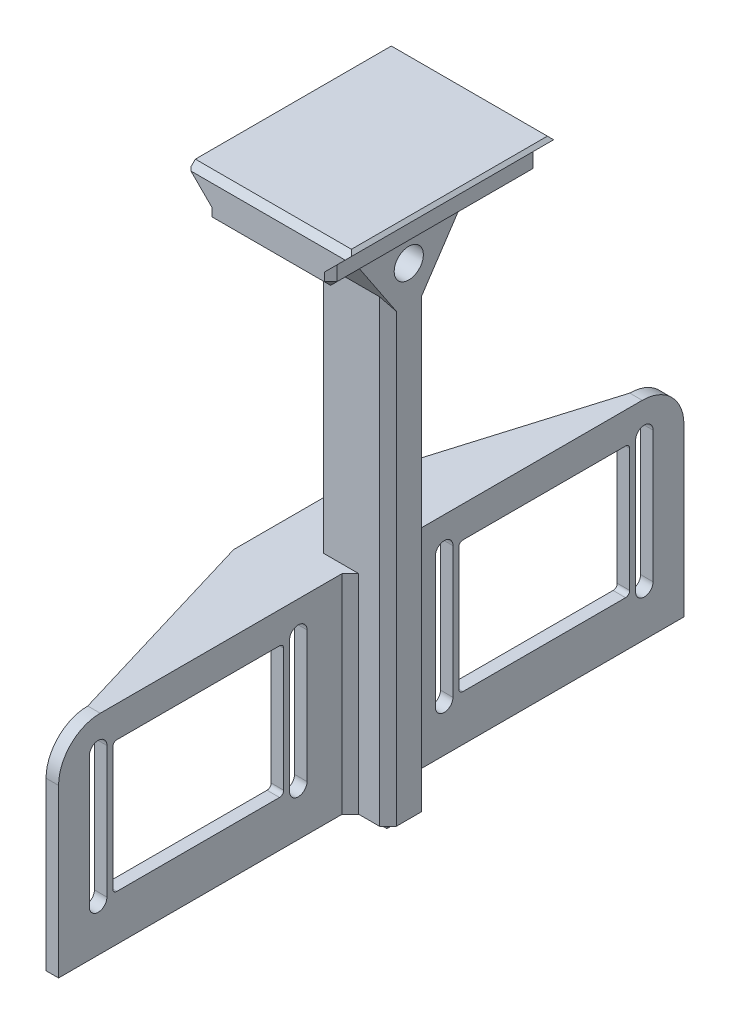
from build123d import *
from OCP.BRepFilletAPI import BRepFilletAPI_MakeChamfer

# Parameters (mm, degrees)
SKETCH_2_W           = 17.5
SKETCH_2_H           = 10
EXTRUDE_1_DEPTH      = 125
SKETCH_3_W           = 50
SKETCH_3_H           = 30
EXTRUDE_2_DEPTH      = 7.5
CHAMFER_1_SIZE       = 1
EXTRUDE_3_DEPTH      = 17.5
CHAMFER_2_SIZE       = 2
CHAMFER_3_SIZE       = 2
SKETCH_6_W           = 10
SKETCH_6_H           = 3
EXTRUDE_4_DEPTH      = 3.1
SKETCH_7_W           = 70
SKETCH_7_H           = 50
EXTRUDE_5_DEPTH      = 3.25
SKETCH_15_W          = 70
SKETCH_15_H          = 50
CUT_EXTRUDE_7_DEPTH  = 0.25
SKETCH_16_W          = 41
SKETCH_16_H          = 31.5
CUT_EXTRUDE_8_DEPTH  = 39.25
CHAMFER_7_SIZE       = 2
FILLET_1_R           = 1
FILLET_2_R           = 10
EXTRUDE_7_DEPTH      = 3
SKETCH_19_W          = 101.779204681
SKETCH_19_H          = 48.287293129
CUT_EXTRUDE_10_DEPTH = 7.5
SKETCH_21_W          = 30
SKETCH_21_H          = 50
EXTRUDE_8_DEPTH      = 10
EXTRUDE_9_DEPTH      = 50
SKETCH_24_W          = 6
SKETCH_24_H          = 6
EXTRUDE_10_DEPTH     = 2
CUT_EXTRUDE_11_DEPTH = 44
CHAMFER_8_SIZE       = 1.5
CHAMFER_8_SIZE2      = 1.060660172
CHAMFER_9_SIZE       = 3
SKETCH_27_R          = 3.5
CUT_EXTRUDE_13_DEPTH = 31


with BuildPart() as part:
    # Sketch 2 → Extrude 1 (new body)
    with BuildSketch(Plane(origin=(0, 0, 0), x_dir=(1, 0, 0), z_dir=(0, 1, 0))):
        with Locations((8.75, 5)):
            Rectangle(SKETCH_2_W, SKETCH_2_H)
    extrude(amount=EXTRUDE_1_DEPTH)

    # Sketch 3 → Extrude 2 (add)
    with BuildSketch(Plane(origin=(0, 125, 0), x_dir=(1, 0, 0), z_dir=(0, 1, 0))):
        with Locations((8.75, 5)):
            Rectangle(SKETCH_3_W, SKETCH_3_H)
    extrude(amount=EXTRUDE_2_DEPTH)

    # Chamfer 1
    chamfer_1_edges = [part.edges().sort_by_distance(p)[0] for p in [
        (33.75, 132.5, -5),
        (8.75, 132.5, -20),
        (-16.25, 132.5, -5),
        (8.75, 132.5, 10),
    ]]
    chamfer(chamfer_1_edges, length=CHAMFER_1_SIZE)

    # Sketch 5 → Extrude 3 (add)
    with BuildSketch(Plane(origin=(17.5, 0, 0), x_dir=(0, 0, -1), z_dir=(1, 0, 0))):
        Polygon((10, 125), (20, 125), (10, 110), align=None)
        Polygon((0, 125), (-10, 125), (0, 110), align=None)
    extrude(amount=-EXTRUDE_3_DEPTH)

    # Chamfer 2
    chamfer_2_edges = [part.edges().sort_by_distance(p)[0] for p in [
        (-8.125, 125, -20),
        (33.75, 125, -5),
        (-16.25, 125, -5),
        (-8.125, 125, 10),
        (25.625, 125, -20),
        (25.625, 125, 10),
    ]]
    chamfer(chamfer_2_edges, length=CHAMFER_2_SIZE)

    # Chamfer 3
    chamfer_3_edges = [part.edges().sort_by_distance(p)[0] for p in [
        (0, 55, -10),
        (17.5, 55, -10),
        (17.5, 55, 0),
        (0, 55, 0),
    ]]
    chamfer(chamfer_3_edges, length=CHAMFER_3_SIZE)

    # Sketch 6 → Extrude 4 (add)
    with BuildSketch(Plane.XZ):
        with Locations((8.75, -5)):
            Rectangle(SKETCH_6_W, SKETCH_6_H)
    extrude(amount=EXTRUDE_4_DEPTH)

    # Sketch 7 → Extrude 5 (add)
    with BuildSketch(Plane.ZY.offset(-8.75)):
        with Locations((-45, 25)):
            Rectangle(SKETCH_7_W, SKETCH_7_H)
    extrude_5 = extrude(amount=EXTRUDE_5_DEPTH)

    # Mirror 1: Extrude 5 across plane
    add(extrude_5.mirror(Plane(origin=(0, 0, -5), x_dir=(1, 0, 0), z_dir=(0, 0, -1))))

    # Sketch 15 → Cut-Extrude 7 (cut)
    with BuildSketch(Plane(origin=(8.75, 0, 0), x_dir=(0, 0, -1), z_dir=(1, 0, 0))):
        with Locations((-35, 25)):
            Rectangle(SKETCH_15_W, SKETCH_15_H)
        with Locations((45, 25)):
            Rectangle(SKETCH_15_W, SKETCH_15_H)
    extrude(amount=-CUT_EXTRUDE_7_DEPTH, mode=Mode.SUBTRACT)

    # Sketch 16 → Cut-Extrude 8 (cut)
    with BuildSketch(Plane.ZY.offset(-5.5)):
        with Locations((-46.5, 26.75)):
            Rectangle(SKETCH_16_W, SKETCH_16_H)
        with Locations((36.5, 26.75)):
            Rectangle(SKETCH_16_W, SKETCH_16_H)
    extrude(amount=-CUT_EXTRUDE_8_DEPTH, mode=Mode.SUBTRACT)

    # Chamfer 7
    chamfer_7_edges = [part.edges().sort_by_distance(p)[0] for p in [
        (5.5, 25, -10),
        (5.5, 25, 0),
        (8.5, 25, 0),
        (8.5, 25, -10),
    ]]
    chamfer(chamfer_7_edges, length=CHAMFER_7_SIZE)

    # Fillet 1
    fillet_1_edges = [part.edges().sort_by_distance(p)[0] for p in [
        (7, 42.5, -26),
        (7, 11, -26),
        (7, 11, -67),
        (7, 42.5, -67),
        (7, 11, 16),
        (7, 42.5, 16),
        (7, 42.5, 57),
        (7, 11, 57),
    ]]
    fillet(fillet_1_edges, radius=FILLET_1_R)

    # Fillet 2
    fillet_2_edges = [part.edges().sort_by_distance(p)[0] for p in [
        (7, 50, -80),
        (7, 50, 70),
    ]]
    fillet(fillet_2_edges, radius=FILLET_2_R)

    # Sketch 17 → Extrude 7 (add)
    with BuildSketch(Plane(origin=(0, 50, 0), x_dir=(1, 0, 0), z_dir=(0, 1, 0))):
        Polygon((5.5, 70), (-9.5, 20), (-9.5, -10), (5.5, -60), align=None)
    extrude(amount=-EXTRUDE_7_DEPTH)

    # Sketch 19 → Cut-Extrude 10 (cut)
    with BuildSketch(Plane(origin=(0, 132.5, 0), x_dir=(1, 0, 0), z_dir=(0, 1, 0))):
        with Locations((10.051154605, 7.674595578)):
            Rectangle(SKETCH_19_W, SKETCH_19_H)
    extrude(amount=-CUT_EXTRUDE_10_DEPTH, mode=Mode.SUBTRACT)

    # Sketch 21 → Extrude 8 (add)
    with BuildSketch(Plane(origin=(0, 125, 0), x_dir=(1, 0, 0), z_dir=(0, 1, 0))):
        with Locations((8.75, 5)):
            Rectangle(SKETCH_21_W, SKETCH_21_H)
    extrude(amount=EXTRUDE_8_DEPTH)

    # Sketch 23 → Extrude 9 (add)
    with BuildSketch(Plane.XY.offset(20)):
        Polygon((23.75, 130), (23.75, 135), (28.75, 135), align=None)
        Polygon((-11.25, 135), (-6.25, 135), (-6.25, 130), align=None)
    extrude(amount=-EXTRUDE_9_DEPTH)

    # Sketch 24 → Extrude 10 (add)
    with BuildSketch(Plane.ZY):
        with Locations((-5, 3)):
            Rectangle(SKETCH_24_W, SKETCH_24_H)
    extrude(amount=EXTRUDE_10_DEPTH)

    # Sketch 25 → Cut-Extrude 11 (cut)
    with BuildSketch(Plane(origin=(8.5, 0, 0), x_dir=(0, 0, -1), z_dir=(1, 0, 0))):
        with BuildLine():
            Line((-14.6, 11), (-14.6, 42.5))
            ThreePointArc((-14.6, 42.5), (-12.5, 44.6), (-10.4, 42.5))
            Line((-10.4, 42.5), (-10.4, 11))
            ThreePointArc((-10.4, 11), (-12.5, 8.9), (-14.6, 11))
        make_face()
        with BuildLine():
            Line((-58.4, 11), (-58.4, 42.5))
            ThreePointArc((-58.4, 42.5), (-60.5, 44.6), (-62.6, 42.5))
            Line((-62.6, 42.5), (-62.6, 11))
            ThreePointArc((-62.6, 11), (-60.5, 8.9), (-58.4, 11))
        make_face()
        with BuildLine():
            Line((24.6, 11), (24.6, 42.5))
            ThreePointArc((24.6, 42.5), (22.5, 44.6), (20.4, 42.5))
            Line((20.4, 42.5), (20.4, 11))
            ThreePointArc((20.4, 11), (22.5, 8.9), (24.6, 11))
        make_face()
        with BuildLine():
            Line((68.4, 11), (68.4, 42.5))
            ThreePointArc((68.4, 42.5), (70.5, 44.6), (72.6, 42.5))
            Line((72.6, 42.5), (72.6, 11))
            ThreePointArc((72.6, 11), (70.5, 8.9), (68.4, 11))
        make_face()
    extrude(amount=-CUT_EXTRUDE_11_DEPTH, mode=Mode.SUBTRACT)

    # Chamfer 8: one chamfer whose edges measure the first distance from different faces: ONE call of the kernel's chamfer builder (chamfer() names one face for all edges)
    chamfer_8_edges_1 = [part.edges().sort_by_distance(p)[0] for p in [
        (8.75, 135, -30),
        (-6.25, 125, -5),
        (8.75, 125, 20),
        (8.75, 135, 20),
        (23.75, 125, -5),
        (8.75, 125, -30),
        (-6.25, 127.5, 20),
        (-6.25, 127.5, -30),
        (23.75, 127.5, -30),
        (23.75, 127.5, 20),
    ]]
    chamfer_8_edges_2 = [part.edges().sort_by_distance(p)[0] for p in [
        (28.75, 135, -5),
    ]]
    chamfer_8_side_2 = [part.faces().sort_by_distance(p)[0] for p in [
        (8.75, 135, -5),
    ]]
    chamfer_8_edges_3 = [part.edges().sort_by_distance(p)[0] for p in [
        (-11.25, 135, -5),
    ]]
    chamfer_8_side_3 = [part.faces().sort_by_distance(p)[0] for p in [
        (-8.75, 132.5, -5),
    ]]
    chamfer_8 = BRepFilletAPI_MakeChamfer(part.part.solid().wrapped)
    for e in chamfer_8_edges_1:
        chamfer_8.Add(CHAMFER_8_SIZE, e.wrapped)
    for e in chamfer_8_edges_2:
        chamfer_8.Add(CHAMFER_8_SIZE, CHAMFER_8_SIZE2, e.wrapped, chamfer_8_side_2[0].wrapped)  # the first distance lies on this face
    for e in chamfer_8_edges_3:
        chamfer_8.Add(CHAMFER_8_SIZE, CHAMFER_8_SIZE2, e.wrapped, chamfer_8_side_3[0].wrapped)  # the first distance lies on this face
    add(Compound.cast(chamfer_8.Shape()), mode=Mode.REPLACE)

    # Chamfer 9
    chamfer_9_edges = [part.edges().sort_by_distance(p)[0] for p in [
        (17.5, 125, -5),
        (0, 125, -5),
    ]]
    chamfer(chamfer_9_edges, length=CHAMFER_9_SIZE)

    # Sketch 27 → Cut-Extrude 13 (cut)
    with BuildSketch(Plane.ZY):
        with Locations((-5, 115.5)):
            Circle(SKETCH_27_R)
    extrude(amount=-CUT_EXTRUDE_13_DEPTH, mode=Mode.SUBTRACT)


solid = part.part
